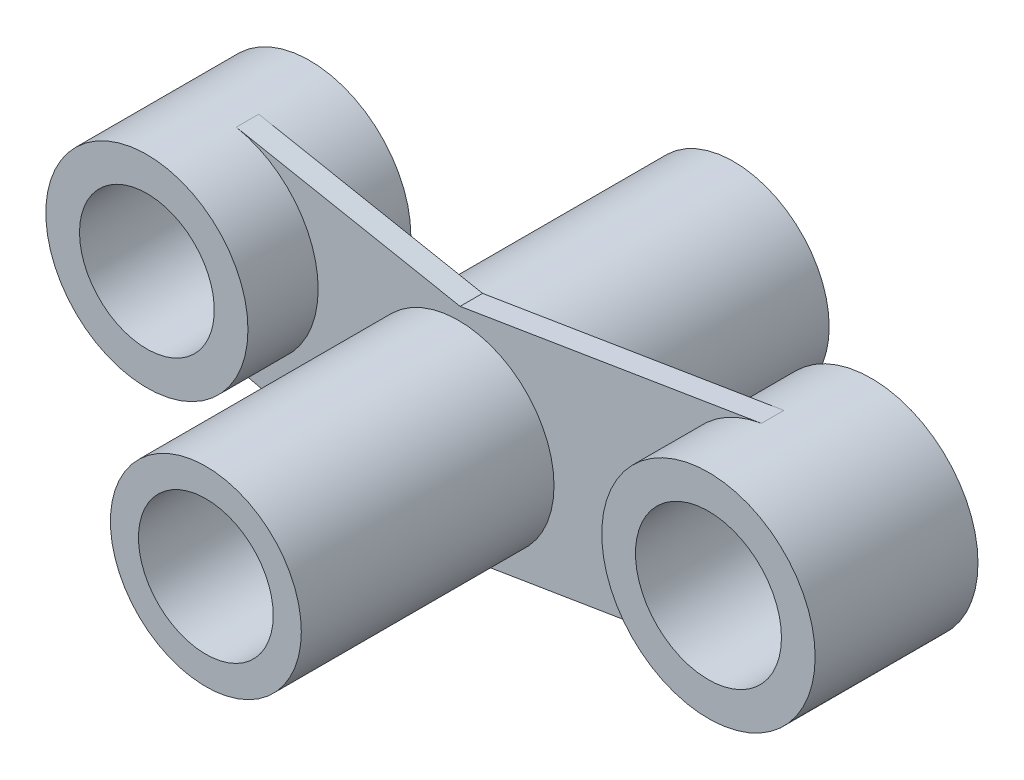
ISO-10303-21;
HEADER;
FILE_DESCRIPTION(('STEP AP214'),'2;1');
FILE_NAME('part.step','',(''),(''),'','','');
FILE_SCHEMA(('AUTOMOTIVE_DESIGN { 1 0 10303 214 1 1 1 1 }'));
ENDSEC;
DATA;
#1=APPLICATION_CONTEXT('core data for automotive mechanical design processes');
#2=APPLICATION_PROTOCOL_DEFINITION('international standard','automotive_design',2000,#1);
#3=PRODUCT_CONTEXT('',#1,'mechanical');
#4=PRODUCT('Part','Part','',(#3));
#5=PRODUCT_RELATED_PRODUCT_CATEGORY('part','',(#4));
#6=PRODUCT_DEFINITION_FORMATION('','',#4);
#7=PRODUCT_DEFINITION_CONTEXT('part definition',#1,'design');
#8=PRODUCT_DEFINITION('design','',#6,#7);
#9=PRODUCT_DEFINITION_SHAPE('','',#8);
#10=(LENGTH_UNIT() NAMED_UNIT(*) SI_UNIT(.MILLI.,.METRE.));
#11=(NAMED_UNIT(*) PLANE_ANGLE_UNIT() SI_UNIT($,.RADIAN.));
#12=(NAMED_UNIT(*) SI_UNIT($,.STERADIAN.) SOLID_ANGLE_UNIT());
#13=UNCERTAINTY_MEASURE_WITH_UNIT(LENGTH_MEASURE(1.E-05),#10,'distance_accuracy_value','');
#14=(GEOMETRIC_REPRESENTATION_CONTEXT(3) GLOBAL_UNCERTAINTY_ASSIGNED_CONTEXT((#13)) GLOBAL_UNIT_ASSIGNED_CONTEXT((#10,
#11,#12)) REPRESENTATION_CONTEXT('',''));
#15=CARTESIAN_POINT('',(0.,0.,0.));
#16=DIRECTION('',(0.,0.,1.));
#17=DIRECTION('',(1.,0.,0.));
#18=AXIS2_PLACEMENT_3D('',#15,#16,#17);
#19=CARTESIAN_POINT('',(43.,-9.32737905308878,2.));
#20=DIRECTION('',(0.,0.,1.));
#21=DIRECTION('',(1.,0.,0.));
#22=AXIS2_PLACEMENT_3D('',#19,#20,#21);
#23=PLANE('',#22);
#24=DIRECTION('',(0.986874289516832,0.161490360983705,0.));
#25=VECTOR('',#24,1.);
#26=CARTESIAN_POINT('',(46.0683168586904,-28.0779905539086,2.));
#27=LINE('',#26,#25);
#28=CARTESIAN_POINT('',(46.0683168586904,-28.0779905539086,2.));
#29=VERTEX_POINT('',#28);
#30=CARTESIAN_POINT('',(103.06831685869,-18.7506115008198,2.));
#31=VERTEX_POINT('',#30);
#32=EDGE_CURVE('E105',#29,#31,#27,.T.);
#33=ORIENTED_EDGE('',*,*,#32,.T.);
#34=CARTESIAN_POINT('',(100.,0.,2.));
#35=DIRECTION('',(0.,0.,1.));
#36=DIRECTION('',(1.,0.,0.));
#37=AXIS2_PLACEMENT_3D('',#34,#35,#36);
#38=CIRCLE('',#37,19.);
#39=CARTESIAN_POINT('',(96.9316831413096,18.7506115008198,2.));
#40=VERTEX_POINT('',#39);
#41=EDGE_CURVE('E112',#31,#40,#38,.F.);
#42=ORIENTED_EDGE('',*,*,#41,.T.);
#43=DIRECTION('',(-0.986874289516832,-0.161490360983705,0.));
#44=VECTOR('',#43,1.);
#45=CARTESIAN_POINT('',(43.2767203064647,9.9706084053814,2.));
#46=LINE('',#45,#44);
#47=CARTESIAN_POINT('',(43.2767203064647,9.9706084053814,2.));
#48=VERTEX_POINT('',#47);
#49=EDGE_CURVE('E94',#40,#48,#46,.T.);
#50=ORIENTED_EDGE('',*,*,#49,.T.);
#51=DIRECTION('',(-0.981838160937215,0.189720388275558,0.));
#52=VECTOR('',#51,1.);
#53=CARTESIAN_POINT('',(43.2767203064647,9.9706084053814,2.));
#54=LINE('',#53,#52);
#55=CARTESIAN_POINT('',(3.41496698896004,17.6730868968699,2.));
#56=VERTEX_POINT('',#55);
#57=EDGE_CURVE('E104',#48,#56,#54,.T.);
#58=ORIENTED_EDGE('',*,*,#57,.T.);
#59=CARTESIAN_POINT('',(0.,0.,2.));
#60=DIRECTION('',(0.,0.,1.));
#61=DIRECTION('',(1.,0.,0.));
#62=AXIS2_PLACEMENT_3D('',#59,#60,#61);
#63=CIRCLE('',#62,18.);
#64=CARTESIAN_POINT('',(-4.21455376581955,-17.4996438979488,2.));
#65=VERTEX_POINT('',#64);
#66=EDGE_CURVE('E51',#65,#56,#63,.T.);
#67=ORIENTED_EDGE('',*,*,#66,.F.);
#68=DIRECTION('',(0.972202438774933,-0.234141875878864,0.));
#69=VECTOR('',#68,1.);
#70=CARTESIAN_POINT('',(38.5513043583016,-27.7992253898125,2.));
#71=LINE('',#70,#69);
#72=CARTESIAN_POINT('',(38.5513043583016,-27.7992253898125,2.));
#73=VERTEX_POINT('',#72);
#74=EDGE_CURVE('E141',#65,#73,#71,.T.);
#75=ORIENTED_EDGE('',*,*,#74,.T.);
#76=CARTESIAN_POINT('',(43.,-9.32737905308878,2.));
#77=DIRECTION('',(0.,0.,1.));
#78=DIRECTION('',(1.,0.,0.));
#79=AXIS2_PLACEMENT_3D('',#76,#77,#78);
#80=CIRCLE('',#79,19.);
#81=EDGE_CURVE('E137',#73,#29,#80,.T.);
#82=ORIENTED_EDGE('',*,*,#81,.T.);
#83=EDGE_LOOP('',(#33,#42,#50,#58,#67,#75,#82));
#84=FACE_BOUND('',#83,.T.);
#85=CARTESIAN_POINT('',(43.,-9.32737905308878,2.));
#86=DIRECTION('',(0.,0.,1.));
#87=DIRECTION('',(1.,0.,0.));
#88=AXIS2_PLACEMENT_3D('',#85,#86,#87);
#89=CIRCLE('',#88,17.);
#90=CARTESIAN_POINT('',(60.,-9.32737905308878,2.));
#91=VERTEX_POINT('',#90);
#92=EDGE_CURVE('E260',#91,#91,#89,.F.);
#93=ORIENTED_EDGE('',*,*,#92,.T.);
#94=EDGE_LOOP('',(#93));
#95=FACE_BOUND('',#94,.T.);
#96=ADVANCED_FACE('F36',(#84,#95),#23,.T.);
#97=CARTESIAN_POINT('',(43.,-9.32737905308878,-2.));
#98=DIRECTION('',(0.,0.,1.));
#99=DIRECTION('',(1.,0.,0.));
#100=AXIS2_PLACEMENT_3D('',#97,#98,#99);
#101=PLANE('',#100);
#102=CARTESIAN_POINT('',(100.,0.,-2.));
#103=DIRECTION('',(0.,0.,1.));
#104=DIRECTION('',(1.,0.,0.));
#105=AXIS2_PLACEMENT_3D('',#102,#103,#104);
#106=CIRCLE('',#105,19.);
#107=CARTESIAN_POINT('',(103.06831685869,-18.7506115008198,-2.));
#108=VERTEX_POINT('',#107);
#109=CARTESIAN_POINT('',(96.9316831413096,18.7506115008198,-2.));
#110=VERTEX_POINT('',#109);
#111=EDGE_CURVE('E113',#108,#110,#106,.F.);
#112=ORIENTED_EDGE('',*,*,#111,.F.);
#113=DIRECTION('',(0.986874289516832,0.161490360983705,0.));
#114=VECTOR('',#113,1.);
#115=CARTESIAN_POINT('',(46.0683168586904,-28.0779905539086,-2.));
#116=LINE('',#115,#114);
#117=CARTESIAN_POINT('',(46.0683168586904,-28.0779905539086,-2.));
#118=VERTEX_POINT('',#117);
#119=EDGE_CURVE('E122',#118,#108,#116,.T.);
#120=ORIENTED_EDGE('',*,*,#119,.F.);
#121=CARTESIAN_POINT('',(43.,-9.32737905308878,-2.));
#122=DIRECTION('',(0.,0.,1.));
#123=DIRECTION('',(1.,0.,0.));
#124=AXIS2_PLACEMENT_3D('',#121,#122,#123);
#125=CIRCLE('',#124,19.);
#126=CARTESIAN_POINT('',(38.5513043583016,-27.7992253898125,-2.));
#127=VERTEX_POINT('',#126);
#128=EDGE_CURVE('E119',#127,#118,#125,.T.);
#129=ORIENTED_EDGE('',*,*,#128,.F.);
#130=DIRECTION('',(0.972202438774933,-0.234141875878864,0.));
#131=VECTOR('',#130,1.);
#132=CARTESIAN_POINT('',(38.5513043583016,-27.7992253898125,-2.));
#133=LINE('',#132,#131);
#134=CARTESIAN_POINT('',(-4.21455376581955,-17.4996438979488,-2.));
#135=VERTEX_POINT('',#134);
#136=EDGE_CURVE('E135',#135,#127,#133,.T.);
#137=ORIENTED_EDGE('',*,*,#136,.F.);
#138=CARTESIAN_POINT('',(0.,0.,-2.));
#139=DIRECTION('',(0.,0.,1.));
#140=DIRECTION('',(1.,0.,0.));
#141=AXIS2_PLACEMENT_3D('',#138,#139,#140);
#142=CIRCLE('',#141,18.);
#143=CARTESIAN_POINT('',(3.41496698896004,17.6730868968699,-2.));
#144=VERTEX_POINT('',#143);
#145=EDGE_CURVE('E155',#135,#144,#142,.T.);
#146=ORIENTED_EDGE('',*,*,#145,.T.);
#147=DIRECTION('',(-0.981838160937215,0.189720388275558,0.));
#148=VECTOR('',#147,1.);
#149=CARTESIAN_POINT('',(43.2767203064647,9.9706084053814,-2.));
#150=LINE('',#149,#148);
#151=CARTESIAN_POINT('',(43.2767203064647,9.9706084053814,-2.));
#152=VERTEX_POINT('',#151);
#153=EDGE_CURVE('E132',#152,#144,#150,.T.);
#154=ORIENTED_EDGE('',*,*,#153,.F.);
#155=DIRECTION('',(-0.986874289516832,-0.161490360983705,0.));
#156=VECTOR('',#155,1.);
#157=CARTESIAN_POINT('',(43.2767203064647,9.9706084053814,-2.));
#158=LINE('',#157,#156);
#159=EDGE_CURVE('E130',#110,#152,#158,.T.);
#160=ORIENTED_EDGE('',*,*,#159,.F.);
#161=EDGE_LOOP('',(#112,#120,#129,#137,#146,#154,#160));
#162=FACE_BOUND('',#161,.T.);
#163=CARTESIAN_POINT('',(43.,-9.32737905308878,-2.));
#164=DIRECTION('',(0.,0.,1.));
#165=DIRECTION('',(1.,0.,0.));
#166=AXIS2_PLACEMENT_3D('',#163,#164,#165);
#167=CIRCLE('',#166,17.);
#168=CARTESIAN_POINT('',(60.,-9.32737905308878,-2.));
#169=VERTEX_POINT('',#168);
#170=EDGE_CURVE('E11',#169,#169,#167,.F.);
#171=ORIENTED_EDGE('',*,*,#170,.F.);
#172=EDGE_LOOP('',(#171));
#173=FACE_BOUND('',#172,.T.);
#174=ADVANCED_FACE('F194',(#162,#173),#101,.F.);
#175=CARTESIAN_POINT('',(0.,0.,14.5));
#176=DIRECTION('',(0.,0.,1.));
#177=DIRECTION('',(1.,0.,0.));
#178=AXIS2_PLACEMENT_3D('',#175,#176,#177);
#179=PLANE('',#178);
#180=CARTESIAN_POINT('',(0.,0.,14.5));
#181=DIRECTION('',(0.,0.,1.));
#182=DIRECTION('',(1.,0.,0.));
#183=AXIS2_PLACEMENT_3D('',#180,#181,#182);
#184=CIRCLE('',#183,18.);
#185=CARTESIAN_POINT('',(18.,0.,14.5));
#186=VERTEX_POINT('',#185);
#187=EDGE_CURVE('E44',#186,#186,#184,.T.);
#188=ORIENTED_EDGE('',*,*,#187,.T.);
#189=EDGE_LOOP('',(#188));
#190=FACE_BOUND('',#189,.T.);
#191=CARTESIAN_POINT('',(0.,0.,14.5));
#192=DIRECTION('',(0.,0.,1.));
#193=DIRECTION('',(1.,0.,0.));
#194=AXIS2_PLACEMENT_3D('',#191,#192,#193);
#195=CIRCLE('',#194,12.);
#196=CARTESIAN_POINT('',(-12.,0.,14.5));
#197=VERTEX_POINT('',#196);
#198=EDGE_CURVE('E161',#197,#197,#195,.T.);
#199=ORIENTED_EDGE('',*,*,#198,.F.);
#200=EDGE_LOOP('',(#199));
#201=FACE_BOUND('',#200,.T.);
#202=ADVANCED_FACE('F169',(#190,#201),#179,.T.);
#203=CARTESIAN_POINT('',(0.,0.,-14.5));
#204=DIRECTION('',(0.,0.,1.));
#205=DIRECTION('',(1.,0.,0.));
#206=AXIS2_PLACEMENT_3D('',#203,#204,#205);
#207=PLANE('',#206);
#208=CARTESIAN_POINT('',(0.,0.,-14.5));
#209=DIRECTION('',(0.,0.,1.));
#210=DIRECTION('',(1.,0.,0.));
#211=AXIS2_PLACEMENT_3D('',#208,#209,#210);
#212=CIRCLE('',#211,18.);
#213=CARTESIAN_POINT('',(18.,0.,-14.5));
#214=VERTEX_POINT('',#213);
#215=EDGE_CURVE('E164',#214,#214,#212,.T.);
#216=ORIENTED_EDGE('',*,*,#215,.F.);
#217=EDGE_LOOP('',(#216));
#218=FACE_BOUND('',#217,.T.);
#219=CARTESIAN_POINT('',(0.,0.,-14.5));
#220=DIRECTION('',(0.,0.,1.));
#221=DIRECTION('',(1.,0.,0.));
#222=AXIS2_PLACEMENT_3D('',#219,#220,#221);
#223=CIRCLE('',#222,12.);
#224=CARTESIAN_POINT('',(-12.,0.,-14.5));
#225=VERTEX_POINT('',#224);
#226=EDGE_CURVE('E158',#225,#225,#223,.T.);
#227=ORIENTED_EDGE('',*,*,#226,.T.);
#228=EDGE_LOOP('',(#227));
#229=FACE_BOUND('',#228,.T.);
#230=ADVANCED_FACE('F175',(#218,#229),#207,.F.);
#231=CARTESIAN_POINT('',(0.,0.,14.5));
#232=DIRECTION('',(0.,0.,-1.));
#233=DIRECTION('',(-1.,0.,0.));
#234=AXIS2_PLACEMENT_3D('',#231,#232,#233);
#235=CYLINDRICAL_SURFACE('',#234,18.);
#236=ORIENTED_EDGE('',*,*,#66,.T.);
#237=DIRECTION('',(0.,0.,-1.));
#238=VECTOR('',#237,1.);
#239=CARTESIAN_POINT('',(3.41496698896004,17.6730868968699,2.));
#240=LINE('',#239,#238);
#241=EDGE_CURVE('E56',#56,#144,#240,.T.);
#242=ORIENTED_EDGE('',*,*,#241,.T.);
#243=ORIENTED_EDGE('',*,*,#145,.F.);
#244=DIRECTION('',(0.,0.,-1.));
#245=VECTOR('',#244,1.);
#246=CARTESIAN_POINT('',(-4.21455376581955,-17.4996438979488,2.));
#247=LINE('',#246,#245);
#248=EDGE_CURVE('E146',#65,#135,#247,.T.);
#249=ORIENTED_EDGE('',*,*,#248,.F.);
#250=EDGE_LOOP('',(#236,#242,#243,#249));
#251=FACE_BOUND('',#250,.T.);
#252=ORIENTED_EDGE('',*,*,#187,.F.);
#253=EDGE_LOOP('',(#252));
#254=FACE_BOUND('',#253,.T.);
#255=ORIENTED_EDGE('',*,*,#215,.T.);
#256=EDGE_LOOP('',(#255));
#257=FACE_BOUND('',#256,.T.);
#258=ADVANCED_FACE('F38',(#251,#254,#257),#235,.T.);
#259=CARTESIAN_POINT('',(0.,0.,14.5));
#260=DIRECTION('',(0.,0.,-1.));
#261=DIRECTION('',(-1.,0.,0.));
#262=AXIS2_PLACEMENT_3D('',#259,#260,#261);
#263=CYLINDRICAL_SURFACE('',#262,12.);
#264=CARTESIAN_POINT('',(-12.,0.,14.5));
#265=CARTESIAN_POINT('',(-12.,0.,14.1979166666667));
#266=CARTESIAN_POINT('',(-12.,0.,13.8958333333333));
#267=CARTESIAN_POINT('',(-12.,0.,13.2916666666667));
#268=CARTESIAN_POINT('',(-12.,0.,12.9895833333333));
#269=CARTESIAN_POINT('',(-12.,0.,12.3854166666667));
#270=CARTESIAN_POINT('',(-12.,0.,12.0833333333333));
#271=CARTESIAN_POINT('',(-12.,0.,11.4791666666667));
#272=CARTESIAN_POINT('',(-12.,0.,11.1770833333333));
#273=CARTESIAN_POINT('',(-12.,0.,10.5729166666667));
#274=CARTESIAN_POINT('',(-12.,0.,10.2708333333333));
#275=CARTESIAN_POINT('',(-12.,0.,9.66666666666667));
#276=CARTESIAN_POINT('',(-12.,0.,9.36458333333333));
#277=CARTESIAN_POINT('',(-12.,0.,8.76041666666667));
#278=CARTESIAN_POINT('',(-12.,0.,8.45833333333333));
#279=CARTESIAN_POINT('',(-12.,0.,7.85416666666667));
#280=CARTESIAN_POINT('',(-12.,0.,7.55208333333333));
#281=CARTESIAN_POINT('',(-12.,0.,6.94791666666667));
#282=CARTESIAN_POINT('',(-12.,0.,6.64583333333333));
#283=CARTESIAN_POINT('',(-12.,0.,6.04166666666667));
#284=CARTESIAN_POINT('',(-12.,0.,5.73958333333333));
#285=CARTESIAN_POINT('',(-12.,0.,5.13541666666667));
#286=CARTESIAN_POINT('',(-12.,0.,4.83333333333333));
#287=CARTESIAN_POINT('',(-12.,0.,4.22916666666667));
#288=CARTESIAN_POINT('',(-12.,0.,3.92708333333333));
#289=CARTESIAN_POINT('',(-12.,0.,3.32291666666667));
#290=CARTESIAN_POINT('',(-12.,0.,3.02083333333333));
#291=CARTESIAN_POINT('',(-12.,0.,2.41666666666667));
#292=CARTESIAN_POINT('',(-12.,0.,2.11458333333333));
#293=CARTESIAN_POINT('',(-12.,0.,1.51041666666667));
#294=CARTESIAN_POINT('',(-12.,0.,1.20833333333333));
#295=CARTESIAN_POINT('',(-12.,0.,0.604166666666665));
#296=CARTESIAN_POINT('',(-12.,0.,0.302083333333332));
#297=CARTESIAN_POINT('',(-12.,0.,-0.302083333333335));
#298=CARTESIAN_POINT('',(-12.,0.,-0.604166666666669));
#299=CARTESIAN_POINT('',(-12.,0.,-1.20833333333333));
#300=CARTESIAN_POINT('',(-12.,0.,-1.51041666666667));
#301=CARTESIAN_POINT('',(-12.,0.,-2.11458333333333));
#302=CARTESIAN_POINT('',(-12.,0.,-2.41666666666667));
#303=CARTESIAN_POINT('',(-12.,0.,-3.02083333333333));
#304=CARTESIAN_POINT('',(-12.,0.,-3.32291666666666));
#305=CARTESIAN_POINT('',(-12.,0.,-3.92708333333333));
#306=CARTESIAN_POINT('',(-12.,0.,-4.22916666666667));
#307=CARTESIAN_POINT('',(-12.,0.,-4.83333333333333));
#308=CARTESIAN_POINT('',(-12.,0.,-5.13541666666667));
#309=CARTESIAN_POINT('',(-12.,0.,-5.73958333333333));
#310=CARTESIAN_POINT('',(-12.,0.,-6.04166666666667));
#311=CARTESIAN_POINT('',(-12.,0.,-6.64583333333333));
#312=CARTESIAN_POINT('',(-12.,0.,-6.94791666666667));
#313=CARTESIAN_POINT('',(-12.,0.,-7.55208333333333));
#314=CARTESIAN_POINT('',(-12.,0.,-7.85416666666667));
#315=CARTESIAN_POINT('',(-12.,0.,-8.45833333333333));
#316=CARTESIAN_POINT('',(-12.,0.,-8.76041666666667));
#317=CARTESIAN_POINT('',(-12.,0.,-9.36458333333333));
#318=CARTESIAN_POINT('',(-12.,0.,-9.66666666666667));
#319=CARTESIAN_POINT('',(-12.,0.,-10.2708333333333));
#320=CARTESIAN_POINT('',(-12.,0.,-10.5729166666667));
#321=CARTESIAN_POINT('',(-12.,0.,-11.1770833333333));
#322=CARTESIAN_POINT('',(-12.,0.,-11.4791666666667));
#323=CARTESIAN_POINT('',(-12.,0.,-12.0833333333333));
#324=CARTESIAN_POINT('',(-12.,0.,-12.3854166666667));
#325=CARTESIAN_POINT('',(-12.,0.,-12.9895833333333));
#326=CARTESIAN_POINT('',(-12.,0.,-13.2916666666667));
#327=CARTESIAN_POINT('',(-12.,0.,-13.8958333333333));
#328=CARTESIAN_POINT('',(-12.,0.,-14.1979166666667));
#329=CARTESIAN_POINT('',(-12.,0.,-14.5));
#330=B_SPLINE_CURVE_WITH_KNOTS('',3,(#264,#265,#266,#267,#268,#269,#270,#271,#272,#273,#274,
#275,#276,#277,#278,#279,#280,#281,#282,#283,#284,#285,#286,#287,#288,#289,#290,#291,#292,#293,
#294,#295,#296,#297,#298,#299,#300,#301,#302,#303,#304,#305,#306,#307,#308,#309,#310,#311,#312,
#313,#314,#315,#316,#317,#318,#319,#320,#321,#322,#323,#324,#325,#326,#327,#328,#329),
.UNSPECIFIED.,.F.,.F.,(4,2,2,2,2,2,2,2,2,2,2,2,2,2,2,2,2,2,2,2,2,2,2,2,2,2,2,2,2,2,2,2,4),(0.,
0.906249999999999,1.8125,2.71875,3.625,4.53125,5.4375,6.34375,7.25,8.15625,9.0625,9.96875,
10.875,11.78125,12.6875,13.59375,14.5,15.40625,16.3125,17.21875,18.125,19.03125,19.9375,
20.84375,21.75,22.65625,23.5625,24.46875,25.375,26.28125,27.1875,28.09375,29.),.UNSPECIFIED.);
#331=EDGE_CURVE('BSEAM174',#197,#225,#330,.T.);
#332=ORIENTED_EDGE('',*,*,#198,.T.);
#333=ORIENTED_EDGE('',*,*,#226,.F.);
#334=ORIENTED_EDGE('',*,*,#331,.T.);
#335=ORIENTED_EDGE('',*,*,#331,.F.);
#336=EDGE_LOOP('',(#332,#334,#333,#335));
#337=FACE_BOUND('',#336,.T.);
#338=ADVANCED_FACE('F174',(#337),#263,.F.);
#339=CARTESIAN_POINT('',(43.,-9.32737905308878,2.));
#340=DIRECTION('',(0.,0.,-1.));
#341=DIRECTION('',(-1.,0.,0.));
#342=AXIS2_PLACEMENT_3D('',#339,#340,#341);
#343=CYLINDRICAL_SURFACE('',#342,19.);
#344=ORIENTED_EDGE('',*,*,#128,.T.);
#345=DIRECTION('',(0.,0.,-1.));
#346=VECTOR('',#345,1.);
#347=CARTESIAN_POINT('',(46.0683168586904,-28.0779905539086,2.));
#348=LINE('',#347,#346);
#349=EDGE_CURVE('E152',#29,#118,#348,.T.);
#350=ORIENTED_EDGE('',*,*,#349,.F.);
#351=ORIENTED_EDGE('',*,*,#81,.F.);
#352=DIRECTION('',(0.,0.,-1.));
#353=VECTOR('',#352,1.);
#354=CARTESIAN_POINT('',(38.5513043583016,-27.7992253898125,2.));
#355=LINE('',#354,#353);
#356=EDGE_CURVE('E143',#73,#127,#355,.T.);
#357=ORIENTED_EDGE('',*,*,#356,.T.);
#358=EDGE_LOOP('',(#344,#350,#351,#357));
#359=FACE_BOUND('',#358,.T.);
#360=ADVANCED_FACE('F184',(#359),#343,.T.);
#361=CARTESIAN_POINT('',(46.0683168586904,-28.0779905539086,2.));
#362=DIRECTION('',(-0.161490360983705,0.986874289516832,0.));
#363=DIRECTION('',(-0.986874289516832,-0.161490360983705,0.));
#364=AXIS2_PLACEMENT_3D('',#361,#362,#363);
#365=PLANE('',#364);
#366=ORIENTED_EDGE('',*,*,#119,.T.);
#367=DIRECTION('',(0.,0.,-1.));
#368=VECTOR('',#367,1.);
#369=CARTESIAN_POINT('',(103.06831685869,-18.7506115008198,2.));
#370=LINE('',#369,#368);
#371=EDGE_CURVE('E114',#31,#108,#370,.T.);
#372=ORIENTED_EDGE('',*,*,#371,.F.);
#373=ORIENTED_EDGE('',*,*,#32,.F.);
#374=ORIENTED_EDGE('',*,*,#349,.T.);
#375=EDGE_LOOP('',(#366,#372,#373,#374));
#376=FACE_BOUND('',#375,.T.);
#377=ADVANCED_FACE('F190',(#376),#365,.F.);
#378=CARTESIAN_POINT('',(100.,0.,2.));
#379=DIRECTION('',(0.,0.,-1.));
#380=DIRECTION('',(-1.,0.,0.));
#381=AXIS2_PLACEMENT_3D('',#378,#379,#380);
#382=CYLINDRICAL_SURFACE('',#381,19.);
#383=ORIENTED_EDGE('',*,*,#371,.T.);
#384=ORIENTED_EDGE('',*,*,#111,.T.);
#385=DIRECTION('',(0.,0.,-1.));
#386=VECTOR('',#385,1.);
#387=CARTESIAN_POINT('',(96.9316831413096,18.7506115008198,2.));
#388=LINE('',#387,#386);
#389=EDGE_CURVE('E97',#40,#110,#388,.T.);
#390=ORIENTED_EDGE('',*,*,#389,.F.);
#391=ORIENTED_EDGE('',*,*,#41,.F.);
#392=EDGE_LOOP('',(#383,#384,#390,#391));
#393=FACE_BOUND('',#392,.T.);
#394=CARTESIAN_POINT('',(100.,0.,-14.5));
#395=DIRECTION('',(0.,0.,1.));
#396=DIRECTION('',(1.,0.,0.));
#397=AXIS2_PLACEMENT_3D('',#394,#395,#396);
#398=CIRCLE('',#397,19.);
#399=CARTESIAN_POINT('',(119.,0.,-14.5));
#400=VERTEX_POINT('',#399);
#401=EDGE_CURVE('E277',#400,#400,#398,.T.);
#402=ORIENTED_EDGE('',*,*,#401,.T.);
#403=EDGE_LOOP('',(#402));
#404=FACE_BOUND('',#403,.T.);
#405=CARTESIAN_POINT('',(100.,0.,14.5));
#406=DIRECTION('',(0.,0.,1.));
#407=DIRECTION('',(1.,0.,0.));
#408=AXIS2_PLACEMENT_3D('',#405,#406,#407);
#409=CIRCLE('',#408,19.);
#410=CARTESIAN_POINT('',(119.,0.,14.5));
#411=VERTEX_POINT('',#410);
#412=EDGE_CURVE('E124',#411,#411,#409,.T.);
#413=ORIENTED_EDGE('',*,*,#412,.F.);
#414=EDGE_LOOP('',(#413));
#415=FACE_BOUND('',#414,.T.);
#416=ADVANCED_FACE('F110',(#393,#404,#415),#382,.T.);
#417=CARTESIAN_POINT('',(43.2767203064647,9.9706084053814,2.));
#418=DIRECTION('',(0.161490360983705,-0.986874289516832,0.));
#419=DIRECTION('',(0.986874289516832,0.161490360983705,0.));
#420=AXIS2_PLACEMENT_3D('',#417,#418,#419);
#421=PLANE('',#420);
#422=ORIENTED_EDGE('',*,*,#159,.T.);
#423=DIRECTION('',(0.,0.,-1.));
#424=VECTOR('',#423,1.);
#425=CARTESIAN_POINT('',(43.2767203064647,9.9706084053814,2.));
#426=LINE('',#425,#424);
#427=EDGE_CURVE('E100',#48,#152,#426,.T.);
#428=ORIENTED_EDGE('',*,*,#427,.F.);
#429=ORIENTED_EDGE('',*,*,#49,.F.);
#430=ORIENTED_EDGE('',*,*,#389,.T.);
#431=EDGE_LOOP('',(#422,#428,#429,#430));
#432=FACE_BOUND('',#431,.T.);
#433=ADVANCED_FACE('F96',(#432),#421,.F.);
#434=CARTESIAN_POINT('',(43.2767203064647,9.9706084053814,2.));
#435=DIRECTION('',(-0.189720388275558,-0.981838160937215,0.));
#436=DIRECTION('',(0.981838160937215,-0.189720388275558,0.));
#437=AXIS2_PLACEMENT_3D('',#434,#435,#436);
#438=PLANE('',#437);
#439=ORIENTED_EDGE('',*,*,#153,.T.);
#440=ORIENTED_EDGE('',*,*,#241,.F.);
#441=ORIENTED_EDGE('',*,*,#57,.F.);
#442=ORIENTED_EDGE('',*,*,#427,.T.);
#443=EDGE_LOOP('',(#439,#440,#441,#442));
#444=FACE_BOUND('',#443,.T.);
#445=ADVANCED_FACE('F207',(#444),#438,.F.);
#446=CARTESIAN_POINT('',(38.5513043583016,-27.7992253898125,2.));
#447=DIRECTION('',(0.234141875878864,0.972202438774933,0.));
#448=DIRECTION('',(-0.972202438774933,0.234141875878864,0.));
#449=AXIS2_PLACEMENT_3D('',#446,#447,#448);
#450=PLANE('',#449);
#451=ORIENTED_EDGE('',*,*,#136,.T.);
#452=ORIENTED_EDGE('',*,*,#356,.F.);
#453=ORIENTED_EDGE('',*,*,#74,.F.);
#454=ORIENTED_EDGE('',*,*,#248,.T.);
#455=EDGE_LOOP('',(#451,#452,#453,#454));
#456=FACE_BOUND('',#455,.T.);
#457=ADVANCED_FACE('F203',(#456),#450,.F.);
#458=CARTESIAN_POINT('',(100.,0.,-14.5));
#459=DIRECTION('',(0.,0.,1.));
#460=DIRECTION('',(1.,0.,0.));
#461=AXIS2_PLACEMENT_3D('',#458,#459,#460);
#462=PLANE('',#461);
#463=ORIENTED_EDGE('',*,*,#401,.F.);
#464=EDGE_LOOP('',(#463));
#465=FACE_BOUND('',#464,.T.);
#466=CARTESIAN_POINT('',(100.,0.,-14.5));
#467=DIRECTION('',(0.,0.,1.));
#468=DIRECTION('',(1.,0.,0.));
#469=AXIS2_PLACEMENT_3D('',#466,#467,#468);
#470=CIRCLE('',#469,13.);
#471=CARTESIAN_POINT('',(113.,0.,-14.5));
#472=VERTEX_POINT('',#471);
#473=EDGE_CURVE('E266',#472,#472,#470,.T.);
#474=ORIENTED_EDGE('',*,*,#473,.T.);
#475=EDGE_LOOP('',(#474));
#476=FACE_BOUND('',#475,.T.);
#477=ADVANCED_FACE('F206',(#465,#476),#462,.F.);
#478=CARTESIAN_POINT('',(100.,0.,2.));
#479=DIRECTION('',(0.,0.,-1.));
#480=DIRECTION('',(-1.,0.,0.));
#481=AXIS2_PLACEMENT_3D('',#478,#479,#480);
#482=CYLINDRICAL_SURFACE('',#481,13.);
#483=ORIENTED_EDGE('',*,*,#473,.F.);
#484=EDGE_LOOP('',(#483));
#485=FACE_BOUND('',#484,.T.);
#486=CARTESIAN_POINT('',(100.,0.,14.5));
#487=DIRECTION('',(0.,0.,1.));
#488=DIRECTION('',(1.,0.,0.));
#489=AXIS2_PLACEMENT_3D('',#486,#487,#488);
#490=CIRCLE('',#489,13.);
#491=CARTESIAN_POINT('',(113.,0.,14.5));
#492=VERTEX_POINT('',#491);
#493=EDGE_CURVE('E274',#492,#492,#490,.T.);
#494=ORIENTED_EDGE('',*,*,#493,.T.);
#495=EDGE_LOOP('',(#494));
#496=FACE_BOUND('',#495,.T.);
#497=ADVANCED_FACE('F244',(#485,#496),#482,.F.);
#498=CARTESIAN_POINT('',(100.,0.,14.5));
#499=DIRECTION('',(0.,0.,1.));
#500=DIRECTION('',(1.,0.,0.));
#501=AXIS2_PLACEMENT_3D('',#498,#499,#500);
#502=PLANE('',#501);
#503=ORIENTED_EDGE('',*,*,#412,.T.);
#504=EDGE_LOOP('',(#503));
#505=FACE_BOUND('',#504,.T.);
#506=ORIENTED_EDGE('',*,*,#493,.F.);
#507=EDGE_LOOP('',(#506));
#508=FACE_BOUND('',#507,.T.);
#509=ADVANCED_FACE('F233',(#505,#508),#502,.T.);
#510=CARTESIAN_POINT('',(43.,-9.32737905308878,47.));
#511=DIRECTION('',(0.,0.,-1.));
#512=DIRECTION('',(-1.,0.,0.));
#513=AXIS2_PLACEMENT_3D('',#510,#511,#512);
#514=CYLINDRICAL_SURFACE('',#513,17.);
#515=CARTESIAN_POINT('',(43.,-9.32737905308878,-47.));
#516=DIRECTION('',(0.,0.,1.));
#517=DIRECTION('',(1.,0.,0.));
#518=AXIS2_PLACEMENT_3D('',#515,#516,#517);
#519=CIRCLE('',#518,17.);
#520=CARTESIAN_POINT('',(60.,-9.32737905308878,-47.));
#521=VERTEX_POINT('',#520);
#522=EDGE_CURVE('E264',#521,#521,#519,.T.);
#523=ORIENTED_EDGE('',*,*,#522,.T.);
#524=EDGE_LOOP('',(#523));
#525=FACE_BOUND('',#524,.T.);
#526=ORIENTED_EDGE('',*,*,#170,.T.);
#527=EDGE_LOOP('',(#526));
#528=FACE_BOUND('',#527,.T.);
#529=ADVANCED_FACE('F230',(#525,#528),#514,.T.);
#530=CARTESIAN_POINT('',(43.,-9.32737905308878,-47.));
#531=DIRECTION('',(0.,0.,1.));
#532=DIRECTION('',(1.,0.,0.));
#533=AXIS2_PLACEMENT_3D('',#530,#531,#532);
#534=PLANE('',#533);
#535=ORIENTED_EDGE('',*,*,#522,.F.);
#536=EDGE_LOOP('',(#535));
#537=FACE_BOUND('',#536,.T.);
#538=CARTESIAN_POINT('',(43.,-9.32737905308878,-47.));
#539=DIRECTION('',(0.,0.,1.));
#540=DIRECTION('',(1.,0.,0.));
#541=AXIS2_PLACEMENT_3D('',#538,#539,#540);
#542=CIRCLE('',#541,12.);
#543=CARTESIAN_POINT('',(55.,-9.32737905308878,-47.));
#544=VERTEX_POINT('',#543);
#545=EDGE_CURVE('E300',#544,#544,#542,.T.);
#546=ORIENTED_EDGE('',*,*,#545,.T.);
#547=EDGE_LOOP('',(#546));
#548=FACE_BOUND('',#547,.T.);
#549=ADVANCED_FACE('F232',(#537,#548),#534,.F.);
#550=CARTESIAN_POINT('',(43.,-9.32737905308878,2.));
#551=DIRECTION('',(0.,0.,-1.));
#552=DIRECTION('',(-1.,0.,0.));
#553=AXIS2_PLACEMENT_3D('',#550,#551,#552);
#554=CYLINDRICAL_SURFACE('',#553,12.);
#555=ORIENTED_EDGE('',*,*,#545,.F.);
#556=EDGE_LOOP('',(#555));
#557=FACE_BOUND('',#556,.T.);
#558=CARTESIAN_POINT('',(43.,-9.32737905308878,47.));
#559=DIRECTION('',(0.,0.,1.));
#560=DIRECTION('',(1.,0.,0.));
#561=AXIS2_PLACEMENT_3D('',#558,#559,#560);
#562=CIRCLE('',#561,12.);
#563=CARTESIAN_POINT('',(55.,-9.32737905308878,47.));
#564=VERTEX_POINT('',#563);
#565=EDGE_CURVE('E268',#564,#564,#562,.T.);
#566=ORIENTED_EDGE('',*,*,#565,.T.);
#567=EDGE_LOOP('',(#566));
#568=FACE_BOUND('',#567,.T.);
#569=ADVANCED_FACE('F241',(#557,#568),#554,.F.);
#570=CARTESIAN_POINT('',(43.,-9.32737905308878,47.));
#571=DIRECTION('',(0.,0.,1.));
#572=DIRECTION('',(1.,0.,0.));
#573=AXIS2_PLACEMENT_3D('',#570,#571,#572);
#574=PLANE('',#573);
#575=CARTESIAN_POINT('',(43.,-9.32737905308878,47.));
#576=DIRECTION('',(0.,0.,1.));
#577=DIRECTION('',(1.,0.,0.));
#578=AXIS2_PLACEMENT_3D('',#575,#576,#577);
#579=CIRCLE('',#578,17.);
#580=CARTESIAN_POINT('',(60.,-9.32737905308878,47.));
#581=VERTEX_POINT('',#580);
#582=EDGE_CURVE('E263',#581,#581,#579,.T.);
#583=ORIENTED_EDGE('',*,*,#582,.T.);
#584=EDGE_LOOP('',(#583));
#585=FACE_BOUND('',#584,.T.);
#586=ORIENTED_EDGE('',*,*,#565,.F.);
#587=EDGE_LOOP('',(#586));
#588=FACE_BOUND('',#587,.T.);
#589=ADVANCED_FACE('F251',(#585,#588),#574,.T.);
#590=ORIENTED_EDGE('',*,*,#92,.F.);
#591=EDGE_LOOP('',(#590));
#592=FACE_BOUND('',#591,.T.);
#593=ORIENTED_EDGE('',*,*,#582,.F.);
#594=EDGE_LOOP('',(#593));
#595=FACE_BOUND('',#594,.T.);
#596=ADVANCED_FACE('F236',(#592,#595),#514,.T.);
#597=CLOSED_SHELL('',(#96,#174,#202,#230,#258,#338,#360,#377,#416,#433,#445,#457,#477,#497,#509,
#529,#549,#569,#589,#596));
#598=MANIFOLD_SOLID_BREP('B2',#597);
#599=ADVANCED_BREP_SHAPE_REPRESENTATION('',(#18,#598),#14);
#600=SHAPE_DEFINITION_REPRESENTATION(#9,#599);
ENDSEC;
END-ISO-10303-21;
